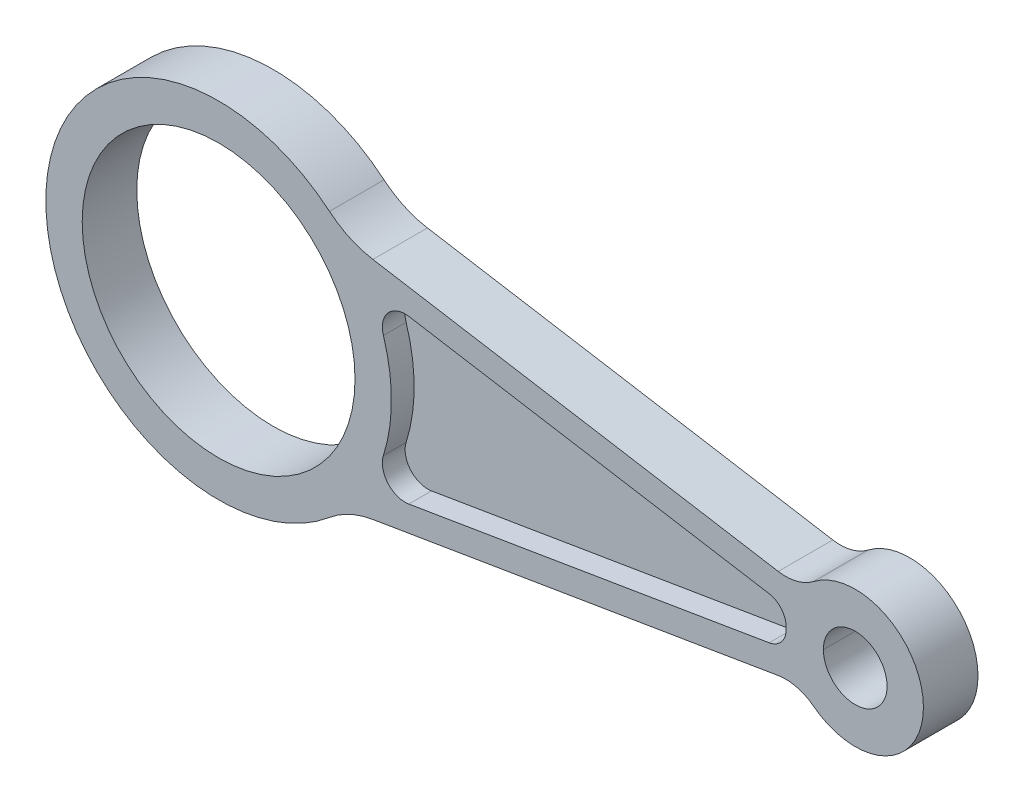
ISO-10303-21;
HEADER;
FILE_DESCRIPTION(('STEP AP214'),'2;1');
FILE_NAME('part.step','',(''),(''),'','','');
FILE_SCHEMA(('AUTOMOTIVE_DESIGN { 1 0 10303 214 1 1 1 1 }'));
ENDSEC;
DATA;
#1=APPLICATION_CONTEXT('core data for automotive mechanical design processes');
#2=APPLICATION_PROTOCOL_DEFINITION('international standard','automotive_design',2000,#1);
#3=PRODUCT_CONTEXT('',#1,'mechanical');
#4=PRODUCT('Part','Part','',(#3));
#5=PRODUCT_RELATED_PRODUCT_CATEGORY('part','',(#4));
#6=PRODUCT_DEFINITION_FORMATION('','',#4);
#7=PRODUCT_DEFINITION_CONTEXT('part definition',#1,'design');
#8=PRODUCT_DEFINITION('design','',#6,#7);
#9=PRODUCT_DEFINITION_SHAPE('','',#8);
#10=(LENGTH_UNIT() NAMED_UNIT(*) SI_UNIT(.MILLI.,.METRE.));
#11=(NAMED_UNIT(*) PLANE_ANGLE_UNIT() SI_UNIT($,.RADIAN.));
#12=(NAMED_UNIT(*) SI_UNIT($,.STERADIAN.) SOLID_ANGLE_UNIT());
#13=UNCERTAINTY_MEASURE_WITH_UNIT(LENGTH_MEASURE(1.E-05),#10,'distance_accuracy_value','');
#14=(GEOMETRIC_REPRESENTATION_CONTEXT(3) GLOBAL_UNCERTAINTY_ASSIGNED_CONTEXT((#13)) GLOBAL_UNIT_ASSIGNED_CONTEXT((#10,
#11,#12)) REPRESENTATION_CONTEXT('',''));
#15=CARTESIAN_POINT('',(0.,0.,0.));
#16=DIRECTION('',(0.,0.,1.));
#17=DIRECTION('',(1.,0.,0.));
#18=AXIS2_PLACEMENT_3D('',#15,#16,#17);
#19=CARTESIAN_POINT('',(140.,0.,12.));
#20=DIRECTION('',(0.,0.,-1.));
#21=DIRECTION('',(-1.,0.,0.));
#22=AXIS2_PLACEMENT_3D('',#19,#20,#21);
#23=CYLINDRICAL_SURFACE('',#22,7.00000000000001);
#24=CARTESIAN_POINT('',(140.,0.,0.));
#25=DIRECTION('',(0.,0.,1.));
#26=DIRECTION('',(1.,0.,0.));
#27=AXIS2_PLACEMENT_3D('',#24,#25,#26);
#28=CIRCLE('',#27,7.00000000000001);
#29=CARTESIAN_POINT('',(133.,0.,0.));
#30=VERTEX_POINT('',#29);
#31=CARTESIAN_POINT('',(147.,0.,0.));
#32=VERTEX_POINT('',#31);
#33=EDGE_CURVE('E305',#30,#32,#28,.T.);
#34=ORIENTED_EDGE('',*,*,#33,.F.);
#35=DIRECTION('',(0.,0.,1.));
#36=VECTOR('',#35,1.);
#37=CARTESIAN_POINT('',(133.,0.,12.));
#38=LINE('',#37,#36);
#39=CARTESIAN_POINT('',(133.,0.,12.));
#40=VERTEX_POINT('',#39);
#41=EDGE_CURVE('E12',#30,#40,#38,.T.);
#42=ORIENTED_EDGE('',*,*,#41,.T.);
#43=CARTESIAN_POINT('',(140.,0.,12.));
#44=DIRECTION('',(0.,0.,1.));
#45=DIRECTION('',(1.,0.,0.));
#46=AXIS2_PLACEMENT_3D('',#43,#44,#45);
#47=CIRCLE('',#46,7.00000000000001);
#48=CARTESIAN_POINT('',(147.,0.,12.));
#49=VERTEX_POINT('',#48);
#50=EDGE_CURVE('E321',#40,#49,#47,.T.);
#51=ORIENTED_EDGE('',*,*,#50,.T.);
#52=DIRECTION('',(0.,0.,-1.));
#53=VECTOR('',#52,1.);
#54=CARTESIAN_POINT('',(147.,0.,12.));
#55=LINE('',#54,#53);
#56=EDGE_CURVE('E45',#49,#32,#55,.T.);
#57=ORIENTED_EDGE('',*,*,#56,.T.);
#58=EDGE_LOOP('',(#34,#42,#51,#57));
#59=FACE_BOUND('',#58,.T.);
#60=ADVANCED_FACE('F37',(#59),#23,.F.);
#61=CARTESIAN_POINT('',(0.,0.,12.));
#62=DIRECTION('',(0.,0.,1.));
#63=DIRECTION('',(1.,0.,0.));
#64=AXIS2_PLACEMENT_3D('',#61,#62,#63);
#65=PLANE('',#64);
#66=CARTESIAN_POINT('',(41.0071259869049,12.9389187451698,12.));
#67=DIRECTION('',(0.,0.,1.));
#68=DIRECTION('',(-1.,0.,0.));
#69=AXIS2_PLACEMENT_3D('',#66,#67,#68);
#70=CIRCLE('',#69,5.);
#71=CARTESIAN_POINT('',(41.8285545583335,17.8709827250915,12.));
#72=VERTEX_POINT('',#71);
#73=CARTESIAN_POINT('',(36.2388555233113,11.4343933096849,12.));
#74=VERTEX_POINT('',#73);
#75=EDGE_CURVE('E252',#72,#74,#70,.T.);
#76=ORIENTED_EDGE('',*,*,#75,.F.);
#77=DIRECTION('',(-0.986412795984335,0.164285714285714,0.));
#78=VECTOR('',#77,1.);
#79=CARTESIAN_POINT('',(41.8285545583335,17.8709827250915,12.));
#80=LINE('',#79,#78);
#81=CARTESIAN_POINT('',(121.046940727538,4.67726787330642,12.));
#82=VERTEX_POINT('',#81);
#83=EDGE_CURVE('E266',#82,#72,#80,.T.);
#84=ORIENTED_EDGE('',*,*,#83,.F.);
#85=CARTESIAN_POINT('',(120.307655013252,0.238410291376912,12.));
#86=DIRECTION('',(0.,0.,1.));
#87=DIRECTION('',(1.,0.,0.));
#88=AXIS2_PLACEMENT_3D('',#85,#86,#87);
#89=CIRCLE('',#88,4.5);
#90=CARTESIAN_POINT('',(124.807655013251,0.238406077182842,12.));
#91=VERTEX_POINT('',#90);
#92=EDGE_CURVE('E298',#91,#82,#89,.T.);
#93=ORIENTED_EDGE('',*,*,#92,.F.);
#94=CARTESIAN_POINT('',(120.332548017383,-0.234264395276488,12.));
#95=DIRECTION('',(0.,0.,1.));
#96=DIRECTION('',(-1.,0.,0.));
#97=AXIS2_PLACEMENT_3D('',#94,#95,#96);
#98=CIRCLE('',#97,4.5);
#99=CARTESIAN_POINT('',(121.071833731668,-4.673121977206,12.));
#100=VERTEX_POINT('',#99);
#101=EDGE_CURVE('E295',#100,#91,#98,.T.);
#102=ORIENTED_EDGE('',*,*,#101,.F.);
#103=DIRECTION('',(0.986412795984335,0.164285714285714,0.));
#104=VECTOR('',#103,1.);
#105=CARTESIAN_POINT('',(41.8285545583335,-17.8709827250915,12.));
#106=LINE('',#105,#104);
#107=CARTESIAN_POINT('',(41.8285545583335,-17.8709827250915,12.));
#108=VERTEX_POINT('',#107);
#109=EDGE_CURVE('E292',#108,#100,#106,.T.);
#110=ORIENTED_EDGE('',*,*,#109,.F.);
#111=CARTESIAN_POINT('',(41.0071259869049,-12.9389187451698,12.));
#112=DIRECTION('',(0.,0.,1.));
#113=DIRECTION('',(-1.,0.,0.));
#114=AXIS2_PLACEMENT_3D('',#111,#112,#113);
#115=CIRCLE('',#114,5.);
#116=CARTESIAN_POINT('',(36.2388555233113,-11.4343933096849,12.));
#117=VERTEX_POINT('',#116);
#118=EDGE_CURVE('E289',#117,#108,#115,.T.);
#119=ORIENTED_EDGE('',*,*,#118,.F.);
#120=CARTESIAN_POINT('',(0.,0.,12.));
#121=DIRECTION('',(0.,0.,-1.));
#122=DIRECTION('',(1.,0.,0.));
#123=AXIS2_PLACEMENT_3D('',#120,#121,#122);
#124=CIRCLE('',#123,38.);
#125=EDGE_CURVE('E286',#74,#117,#124,.T.);
#126=ORIENTED_EDGE('',*,*,#125,.F.);
#127=EDGE_LOOP('',(#76,#84,#93,#102,#110,#119,#126));
#128=FACE_BOUND('',#127,.T.);
#129=CARTESIAN_POINT('',(0.,0.,12.));
#130=DIRECTION('',(0.,0.,1.));
#131=DIRECTION('',(1.,0.,0.));
#132=AXIS2_PLACEMENT_3D('',#129,#130,#131);
#133=CIRCLE('',#132,30.);
#134=CARTESIAN_POINT('',(30.,0.,12.));
#135=VERTEX_POINT('',#134);
#136=EDGE_CURVE('E325',#135,#135,#133,.T.);
#137=ORIENTED_EDGE('',*,*,#136,.F.);
#138=EDGE_LOOP('',(#137));
#139=FACE_BOUND('',#138,.T.);
#140=DIRECTION('',(-0.986412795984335,0.164285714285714,0.));
#141=VECTOR('',#140,1.);
#142=CARTESIAN_POINT('',(27.9354736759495,25.7606154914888,12.));
#143=LINE('',#142,#141);
#144=CARTESIAN_POINT('',(123.068754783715,9.91629645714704,12.));
#145=VERTEX_POINT('',#144);
#146=CARTESIAN_POINT('',(33.9230677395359,24.7633898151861,12.));
#147=VERTEX_POINT('',#146);
#148=EDGE_CURVE('E340',#145,#147,#143,.T.);
#149=ORIENTED_EDGE('',*,*,#148,.T.);
#150=CARTESIAN_POINT('',(37.2087820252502,44.4916457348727,12.));
#151=DIRECTION('',(0.,0.,1.));
#152=DIRECTION('',(1.,0.,0.));
#153=AXIS2_PLACEMENT_3D('',#150,#151,#152);
#154=CIRCLE('',#153,20.);
#155=CARTESIAN_POINT('',(24.3781675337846,29.1496989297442,12.));
#156=VERTEX_POINT('',#155);
#157=EDGE_CURVE('E388',#147,#156,#154,.F.);
#158=ORIENTED_EDGE('',*,*,#157,.T.);
#159=CARTESIAN_POINT('',(0.,0.,12.));
#160=DIRECTION('',(0.,0.,1.));
#161=DIRECTION('',(1.,0.,0.));
#162=AXIS2_PLACEMENT_3D('',#159,#160,#161);
#163=CIRCLE('',#162,38.);
#164=CARTESIAN_POINT('',(24.3781675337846,-29.1496989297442,12.));
#165=VERTEX_POINT('',#164);
#166=EDGE_CURVE('E331',#156,#165,#163,.T.);
#167=ORIENTED_EDGE('',*,*,#166,.T.);
#168=CARTESIAN_POINT('',(37.2087820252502,-44.4916457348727,12.));
#169=DIRECTION('',(0.,0.,1.));
#170=DIRECTION('',(1.,0.,0.));
#171=AXIS2_PLACEMENT_3D('',#168,#169,#170);
#172=CIRCLE('',#171,20.);
#173=CARTESIAN_POINT('',(33.9230677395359,-24.7633898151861,12.));
#174=VERTEX_POINT('',#173);
#175=EDGE_CURVE('E384',#165,#174,#172,.F.);
#176=ORIENTED_EDGE('',*,*,#175,.T.);
#177=DIRECTION('',(0.986412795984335,0.164285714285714,0.));
#178=VECTOR('',#177,1.);
#179=CARTESIAN_POINT('',(27.9354736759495,-25.7606154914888,12.));
#180=LINE('',#179,#178);
#181=CARTESIAN_POINT('',(123.068754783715,-9.91629645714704,12.));
#182=VERTEX_POINT('',#181);
#183=EDGE_CURVE('E334',#174,#182,#180,.T.);
#184=ORIENTED_EDGE('',*,*,#183,.T.);
#185=CARTESIAN_POINT('',(124.711611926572,-19.7804244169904,12.));
#186=DIRECTION('',(0.,0.,1.));
#187=DIRECTION('',(1.,0.,0.));
#188=AXIS2_PLACEMENT_3D('',#185,#186,#187);
#189=CIRCLE('',#188,10.);
#190=CARTESIAN_POINT('',(130.826967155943,-11.8682546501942,12.));
#191=VERTEX_POINT('',#190);
#192=EDGE_CURVE('E366',#182,#191,#189,.F.);
#193=ORIENTED_EDGE('',*,*,#192,.T.);
#194=CARTESIAN_POINT('',(140.,0.,12.));
#195=DIRECTION('',(0.,0.,1.));
#196=DIRECTION('',(1.,0.,0.));
#197=AXIS2_PLACEMENT_3D('',#194,#195,#196);
#198=CIRCLE('',#197,15.);
#199=CARTESIAN_POINT('',(130.826967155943,11.8682546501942,12.));
#200=VERTEX_POINT('',#199);
#201=EDGE_CURVE('E337',#191,#200,#198,.T.);
#202=ORIENTED_EDGE('',*,*,#201,.T.);
#203=CARTESIAN_POINT('',(124.711611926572,19.7804244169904,12.));
#204=DIRECTION('',(0.,0.,1.));
#205=DIRECTION('',(1.,0.,0.));
#206=AXIS2_PLACEMENT_3D('',#203,#204,#205);
#207=CIRCLE('',#206,10.);
#208=EDGE_CURVE('E370',#200,#145,#207,.F.);
#209=ORIENTED_EDGE('',*,*,#208,.T.);
#210=EDGE_LOOP('',(#149,#158,#167,#176,#184,#193,#202,#209));
#211=FACE_BOUND('',#210,.T.);
#212=EDGE_CURVE('E318',#49,#40,#47,.T.);
#213=ORIENTED_EDGE('',*,*,#212,.F.);
#214=ORIENTED_EDGE('',*,*,#50,.F.);
#215=EDGE_LOOP('',(#213,#214));
#216=FACE_BOUND('',#215,.T.);
#217=ADVANCED_FACE('F397',(#128,#139,#211,#216),#65,.T.);
#218=CARTESIAN_POINT('',(0.,0.,0.));
#219=DIRECTION('',(0.,0.,1.));
#220=DIRECTION('',(1.,0.,0.));
#221=AXIS2_PLACEMENT_3D('',#218,#219,#220);
#222=PLANE('',#221);
#223=CARTESIAN_POINT('',(0.,6.5746019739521E-13,0.));
#224=DIRECTION('',(0.,0.,1.));
#225=DIRECTION('',(-1.,0.,0.));
#226=AXIS2_PLACEMENT_3D('',#223,#224,#225);
#227=CIRCLE('',#226,38.);
#228=CARTESIAN_POINT('',(36.2388555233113,-11.4343933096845,0.));
#229=VERTEX_POINT('',#228);
#230=CARTESIAN_POINT('',(36.2388555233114,11.4343933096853,0.));
#231=VERTEX_POINT('',#230);
#232=EDGE_CURVE('E237',#229,#231,#227,.T.);
#233=ORIENTED_EDGE('',*,*,#232,.F.);
#234=CARTESIAN_POINT('',(41.0071259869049,-12.9389187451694,0.));
#235=DIRECTION('',(0.,0.,-1.));
#236=DIRECTION('',(1.,0.,0.));
#237=AXIS2_PLACEMENT_3D('',#234,#235,#236);
#238=CIRCLE('',#237,4.99999999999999);
#239=CARTESIAN_POINT('',(41.8285545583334,-17.8709827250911,0.));
#240=VERTEX_POINT('',#239);
#241=EDGE_CURVE('E202',#240,#229,#238,.T.);
#242=ORIENTED_EDGE('',*,*,#241,.F.);
#243=DIRECTION('',(-0.986412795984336,-0.164285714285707,0.));
#244=VECTOR('',#243,1.);
#245=CARTESIAN_POINT('',(41.8285545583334,-17.8709827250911,0.));
#246=LINE('',#245,#244);
#247=CARTESIAN_POINT('',(121.046940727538,-4.67726787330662,0.));
#248=VERTEX_POINT('',#247);
#249=EDGE_CURVE('E220',#248,#240,#246,.T.);
#250=ORIENTED_EDGE('',*,*,#249,.F.);
#251=CARTESIAN_POINT('',(120.307655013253,-0.23841029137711,0.));
#252=DIRECTION('',(0.,0.,-1.));
#253=DIRECTION('',(-1.,0.,0.));
#254=AXIS2_PLACEMENT_3D('',#251,#252,#253);
#255=CIRCLE('',#254,4.5);
#256=CARTESIAN_POINT('',(124.807655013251,-0.238406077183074,0.));
#257=VERTEX_POINT('',#256);
#258=EDGE_CURVE('E223',#257,#248,#255,.T.);
#259=ORIENTED_EDGE('',*,*,#258,.F.);
#260=CARTESIAN_POINT('',(120.332548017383,0.234264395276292,0.));
#261=DIRECTION('',(0.,0.,-1.));
#262=DIRECTION('',(1.,0.,0.));
#263=AXIS2_PLACEMENT_3D('',#260,#261,#262);
#264=CIRCLE('',#263,4.49999999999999);
#265=CARTESIAN_POINT('',(121.071833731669,4.67312197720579,0.));
#266=VERTEX_POINT('',#265);
#267=EDGE_CURVE('E245',#266,#257,#264,.T.);
#268=ORIENTED_EDGE('',*,*,#267,.F.);
#269=DIRECTION('',(0.986412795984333,-0.164285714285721,0.));
#270=VECTOR('',#269,1.);
#271=CARTESIAN_POINT('',(41.8285545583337,17.8709827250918,0.));
#272=LINE('',#271,#270);
#273=CARTESIAN_POINT('',(41.8285545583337,17.8709827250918,0.));
#274=VERTEX_POINT('',#273);
#275=EDGE_CURVE('E242',#274,#266,#272,.T.);
#276=ORIENTED_EDGE('',*,*,#275,.F.);
#277=CARTESIAN_POINT('',(41.0071259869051,12.9389187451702,0.));
#278=DIRECTION('',(0.,0.,-1.));
#279=DIRECTION('',(1.,0.,0.));
#280=AXIS2_PLACEMENT_3D('',#277,#278,#279);
#281=CIRCLE('',#280,5.00000000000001);
#282=EDGE_CURVE('E239',#231,#274,#281,.T.);
#283=ORIENTED_EDGE('',*,*,#282,.F.);
#284=EDGE_LOOP('',(#233,#242,#250,#259,#268,#276,#283));
#285=FACE_BOUND('',#284,.T.);
#286=CARTESIAN_POINT('',(0.,0.,0.));
#287=DIRECTION('',(0.,0.,1.));
#288=DIRECTION('',(1.,0.,0.));
#289=AXIS2_PLACEMENT_3D('',#286,#287,#288);
#290=CIRCLE('',#289,30.);
#291=CARTESIAN_POINT('',(30.,0.,0.));
#292=VERTEX_POINT('',#291);
#293=EDGE_CURVE('E320',#292,#292,#290,.T.);
#294=ORIENTED_EDGE('',*,*,#293,.T.);
#295=EDGE_LOOP('',(#294));
#296=FACE_BOUND('',#295,.T.);
#297=CARTESIAN_POINT('',(0.,0.,0.));
#298=DIRECTION('',(0.,0.,1.));
#299=DIRECTION('',(1.,0.,0.));
#300=AXIS2_PLACEMENT_3D('',#297,#298,#299);
#301=CIRCLE('',#300,38.);
#302=CARTESIAN_POINT('',(24.3781675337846,29.1496989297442,0.));
#303=VERTEX_POINT('',#302);
#304=CARTESIAN_POINT('',(24.3781675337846,-29.1496989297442,0.));
#305=VERTEX_POINT('',#304);
#306=EDGE_CURVE('E328',#303,#305,#301,.T.);
#307=ORIENTED_EDGE('',*,*,#306,.F.);
#308=CARTESIAN_POINT('',(37.2087820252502,44.4916457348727,0.));
#309=DIRECTION('',(0.,0.,1.));
#310=DIRECTION('',(1.,0.,0.));
#311=AXIS2_PLACEMENT_3D('',#308,#309,#310);
#312=CIRCLE('',#311,20.);
#313=CARTESIAN_POINT('',(33.9230677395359,24.7633898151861,0.));
#314=VERTEX_POINT('',#313);
#315=EDGE_CURVE('E386',#303,#314,#312,.T.);
#316=ORIENTED_EDGE('',*,*,#315,.T.);
#317=DIRECTION('',(-0.986412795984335,0.164285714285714,0.));
#318=VECTOR('',#317,1.);
#319=CARTESIAN_POINT('',(27.9354736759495,25.7606154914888,0.));
#320=LINE('',#319,#318);
#321=CARTESIAN_POINT('',(123.068754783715,9.91629645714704,0.));
#322=VERTEX_POINT('',#321);
#323=EDGE_CURVE('E335',#322,#314,#320,.T.);
#324=ORIENTED_EDGE('',*,*,#323,.F.);
#325=CARTESIAN_POINT('',(124.711611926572,19.7804244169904,0.));
#326=DIRECTION('',(0.,0.,1.));
#327=DIRECTION('',(1.,0.,0.));
#328=AXIS2_PLACEMENT_3D('',#325,#326,#327);
#329=CIRCLE('',#328,10.);
#330=CARTESIAN_POINT('',(130.826967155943,11.8682546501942,0.));
#331=VERTEX_POINT('',#330);
#332=EDGE_CURVE('E368',#322,#331,#329,.T.);
#333=ORIENTED_EDGE('',*,*,#332,.T.);
#334=CARTESIAN_POINT('',(140.,0.,0.));
#335=DIRECTION('',(0.,0.,1.));
#336=DIRECTION('',(1.,0.,0.));
#337=AXIS2_PLACEMENT_3D('',#334,#335,#336);
#338=CIRCLE('',#337,15.);
#339=CARTESIAN_POINT('',(130.826967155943,-11.8682546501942,0.));
#340=VERTEX_POINT('',#339);
#341=EDGE_CURVE('E348',#340,#331,#338,.T.);
#342=ORIENTED_EDGE('',*,*,#341,.F.);
#343=CARTESIAN_POINT('',(124.711611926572,-19.7804244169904,0.));
#344=DIRECTION('',(0.,0.,1.));
#345=DIRECTION('',(1.,0.,0.));
#346=AXIS2_PLACEMENT_3D('',#343,#344,#345);
#347=CIRCLE('',#346,10.);
#348=CARTESIAN_POINT('',(123.068754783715,-9.91629645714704,0.));
#349=VERTEX_POINT('',#348);
#350=EDGE_CURVE('E363',#340,#349,#347,.T.);
#351=ORIENTED_EDGE('',*,*,#350,.T.);
#352=DIRECTION('',(0.986412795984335,0.164285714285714,0.));
#353=VECTOR('',#352,1.);
#354=CARTESIAN_POINT('',(27.9354736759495,-25.7606154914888,0.));
#355=LINE('',#354,#353);
#356=CARTESIAN_POINT('',(33.9230677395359,-24.7633898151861,0.));
#357=VERTEX_POINT('',#356);
#358=EDGE_CURVE('E346',#357,#349,#355,.T.);
#359=ORIENTED_EDGE('',*,*,#358,.F.);
#360=CARTESIAN_POINT('',(37.2087820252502,-44.4916457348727,0.));
#361=DIRECTION('',(0.,0.,1.));
#362=DIRECTION('',(1.,0.,0.));
#363=AXIS2_PLACEMENT_3D('',#360,#361,#362);
#364=CIRCLE('',#363,20.);
#365=EDGE_CURVE('E382',#357,#305,#364,.T.);
#366=ORIENTED_EDGE('',*,*,#365,.T.);
#367=EDGE_LOOP('',(#307,#316,#324,#333,#342,#351,#359,#366));
#368=FACE_BOUND('',#367,.T.);
#369=EDGE_CURVE('E322',#32,#30,#28,.T.);
#370=ORIENTED_EDGE('',*,*,#369,.T.);
#371=ORIENTED_EDGE('',*,*,#33,.T.);
#372=EDGE_LOOP('',(#370,#371));
#373=FACE_BOUND('',#372,.T.);
#374=ADVANCED_FACE('F394',(#285,#296,#368,#373),#222,.F.);
#375=CARTESIAN_POINT('',(0.,0.,12.));
#376=DIRECTION('',(0.,0.,-1.));
#377=DIRECTION('',(-1.,0.,0.));
#378=AXIS2_PLACEMENT_3D('',#375,#376,#377);
#379=CYLINDRICAL_SURFACE('',#378,38.);
#380=ORIENTED_EDGE('',*,*,#306,.T.);
#381=DIRECTION('',(0.,0.,-1.));
#382=VECTOR('',#381,1.);
#383=CARTESIAN_POINT('',(24.3781675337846,-29.1496989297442,12.));
#384=LINE('',#383,#382);
#385=EDGE_CURVE('E378',#305,#165,#384,.F.);
#386=ORIENTED_EDGE('',*,*,#385,.T.);
#387=ORIENTED_EDGE('',*,*,#166,.F.);
#388=DIRECTION('',(0.,0.,-1.));
#389=VECTOR('',#388,1.);
#390=CARTESIAN_POINT('',(24.3781675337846,29.1496989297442,12.));
#391=LINE('',#390,#389);
#392=EDGE_CURVE('E375',#156,#303,#391,.T.);
#393=ORIENTED_EDGE('',*,*,#392,.T.);
#394=EDGE_LOOP('',(#380,#386,#387,#393));
#395=FACE_BOUND('',#394,.T.);
#396=ADVANCED_FACE('F396',(#395),#379,.T.);
#397=CARTESIAN_POINT('',(27.9354736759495,-25.7606154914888,12.));
#398=DIRECTION('',(-0.164285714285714,0.986412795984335,0.));
#399=DIRECTION('',(-0.986412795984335,-0.164285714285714,0.));
#400=AXIS2_PLACEMENT_3D('',#397,#398,#399);
#401=PLANE('',#400);
#402=ORIENTED_EDGE('',*,*,#183,.F.);
#403=DIRECTION('',(0.,0.,1.));
#404=VECTOR('',#403,1.);
#405=CARTESIAN_POINT('',(33.9230677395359,-24.7633898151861,0.));
#406=LINE('',#405,#404);
#407=EDGE_CURVE('E372',#174,#357,#406,.F.);
#408=ORIENTED_EDGE('',*,*,#407,.T.);
#409=ORIENTED_EDGE('',*,*,#358,.T.);
#410=DIRECTION('',(0.,0.,1.));
#411=VECTOR('',#410,1.);
#412=CARTESIAN_POINT('',(123.068754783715,-9.91629645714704,12.));
#413=LINE('',#412,#411);
#414=EDGE_CURVE('E357',#349,#182,#413,.T.);
#415=ORIENTED_EDGE('',*,*,#414,.T.);
#416=EDGE_LOOP('',(#402,#408,#409,#415));
#417=FACE_BOUND('',#416,.T.);
#418=ADVANCED_FACE('F405',(#417),#401,.F.);
#419=CARTESIAN_POINT('',(140.,0.,12.));
#420=DIRECTION('',(0.,0.,-1.));
#421=DIRECTION('',(-1.,0.,0.));
#422=AXIS2_PLACEMENT_3D('',#419,#420,#421);
#423=CYLINDRICAL_SURFACE('',#422,15.);
#424=ORIENTED_EDGE('',*,*,#201,.F.);
#425=DIRECTION('',(0.,0.,-1.));
#426=VECTOR('',#425,1.);
#427=CARTESIAN_POINT('',(130.826967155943,-11.8682546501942,12.));
#428=LINE('',#427,#426);
#429=EDGE_CURVE('E354',#191,#340,#428,.T.);
#430=ORIENTED_EDGE('',*,*,#429,.T.);
#431=ORIENTED_EDGE('',*,*,#341,.T.);
#432=DIRECTION('',(0.,0.,-1.));
#433=VECTOR('',#432,1.);
#434=CARTESIAN_POINT('',(130.826967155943,11.8682546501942,12.));
#435=LINE('',#434,#433);
#436=EDGE_CURVE('E343',#331,#200,#435,.F.);
#437=ORIENTED_EDGE('',*,*,#436,.T.);
#438=EDGE_LOOP('',(#424,#430,#431,#437));
#439=FACE_BOUND('',#438,.T.);
#440=ADVANCED_FACE('F434',(#439),#423,.T.);
#441=CARTESIAN_POINT('',(27.9354736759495,25.7606154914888,12.));
#442=DIRECTION('',(-0.164285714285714,-0.986412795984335,0.));
#443=DIRECTION('',(0.986412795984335,-0.164285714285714,0.));
#444=AXIS2_PLACEMENT_3D('',#441,#442,#443);
#445=PLANE('',#444);
#446=ORIENTED_EDGE('',*,*,#323,.T.);
#447=DIRECTION('',(0.,0.,1.));
#448=VECTOR('',#447,1.);
#449=CARTESIAN_POINT('',(33.9230677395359,24.7633898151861,12.));
#450=LINE('',#449,#448);
#451=EDGE_CURVE('E380',#314,#147,#450,.T.);
#452=ORIENTED_EDGE('',*,*,#451,.T.);
#453=ORIENTED_EDGE('',*,*,#148,.F.);
#454=DIRECTION('',(0.,0.,1.));
#455=VECTOR('',#454,1.);
#456=CARTESIAN_POINT('',(123.068754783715,9.91629645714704,0.));
#457=LINE('',#456,#455);
#458=EDGE_CURVE('E360',#145,#322,#457,.F.);
#459=ORIENTED_EDGE('',*,*,#458,.T.);
#460=EDGE_LOOP('',(#446,#452,#453,#459));
#461=FACE_BOUND('',#460,.T.);
#462=ADVANCED_FACE('F428',(#461),#445,.F.);
#463=CARTESIAN_POINT('',(0.,0.,12.));
#464=DIRECTION('',(0.,0.,-1.));
#465=DIRECTION('',(-1.,0.,0.));
#466=AXIS2_PLACEMENT_3D('',#463,#464,#465);
#467=CYLINDRICAL_SURFACE('',#466,30.);
#468=ORIENTED_EDGE('',*,*,#136,.T.);
#469=EDGE_LOOP('',(#468));
#470=FACE_BOUND('',#469,.T.);
#471=ORIENTED_EDGE('',*,*,#293,.F.);
#472=EDGE_LOOP('',(#471));
#473=FACE_BOUND('',#472,.T.);
#474=ADVANCED_FACE('F420',(#470,#473),#467,.F.);
#475=ORIENTED_EDGE('',*,*,#41,.F.);
#476=ORIENTED_EDGE('',*,*,#369,.F.);
#477=ORIENTED_EDGE('',*,*,#56,.F.);
#478=ORIENTED_EDGE('',*,*,#212,.T.);
#479=EDGE_LOOP('',(#475,#476,#477,#478));
#480=FACE_BOUND('',#479,.T.);
#481=ADVANCED_FACE('F392',(#480),#23,.F.);
#482=CARTESIAN_POINT('',(124.711611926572,-19.7804244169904,12.));
#483=DIRECTION('',(0.,0.,-1.));
#484=DIRECTION('',(-1.,0.,0.));
#485=AXIS2_PLACEMENT_3D('',#482,#483,#484);
#486=CYLINDRICAL_SURFACE('',#485,10.);
#487=ORIENTED_EDGE('',*,*,#192,.F.);
#488=ORIENTED_EDGE('',*,*,#414,.F.);
#489=ORIENTED_EDGE('',*,*,#350,.F.);
#490=ORIENTED_EDGE('',*,*,#429,.F.);
#491=EDGE_LOOP('',(#487,#488,#489,#490));
#492=FACE_BOUND('',#491,.T.);
#493=ADVANCED_FACE('F419',(#492),#486,.F.);
#494=CARTESIAN_POINT('',(124.711611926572,19.7804244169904,12.));
#495=DIRECTION('',(0.,0.,-1.));
#496=DIRECTION('',(-1.,0.,0.));
#497=AXIS2_PLACEMENT_3D('',#494,#495,#496);
#498=CYLINDRICAL_SURFACE('',#497,10.);
#499=ORIENTED_EDGE('',*,*,#208,.F.);
#500=ORIENTED_EDGE('',*,*,#436,.F.);
#501=ORIENTED_EDGE('',*,*,#332,.F.);
#502=ORIENTED_EDGE('',*,*,#458,.F.);
#503=EDGE_LOOP('',(#499,#500,#501,#502));
#504=FACE_BOUND('',#503,.T.);
#505=ADVANCED_FACE('F424',(#504),#498,.F.);
#506=CARTESIAN_POINT('',(37.2087820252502,-44.4916457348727,12.));
#507=DIRECTION('',(0.,0.,-1.));
#508=DIRECTION('',(-1.,0.,0.));
#509=AXIS2_PLACEMENT_3D('',#506,#507,#508);
#510=CYLINDRICAL_SURFACE('',#509,20.);
#511=ORIENTED_EDGE('',*,*,#175,.F.);
#512=ORIENTED_EDGE('',*,*,#385,.F.);
#513=ORIENTED_EDGE('',*,*,#365,.F.);
#514=ORIENTED_EDGE('',*,*,#407,.F.);
#515=EDGE_LOOP('',(#511,#512,#513,#514));
#516=FACE_BOUND('',#515,.T.);
#517=ADVANCED_FACE('F448',(#516),#510,.F.);
#518=CARTESIAN_POINT('',(37.2087820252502,44.4916457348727,12.));
#519=DIRECTION('',(0.,0.,-1.));
#520=DIRECTION('',(-1.,0.,0.));
#521=AXIS2_PLACEMENT_3D('',#518,#519,#520);
#522=CYLINDRICAL_SURFACE('',#521,20.);
#523=ORIENTED_EDGE('',*,*,#157,.F.);
#524=ORIENTED_EDGE('',*,*,#451,.F.);
#525=ORIENTED_EDGE('',*,*,#315,.F.);
#526=ORIENTED_EDGE('',*,*,#392,.F.);
#527=EDGE_LOOP('',(#523,#524,#525,#526));
#528=FACE_BOUND('',#527,.T.);
#529=ADVANCED_FACE('F39',(#528),#522,.F.);
#530=CARTESIAN_POINT('',(41.0071259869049,12.9389187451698,7.));
#531=DIRECTION('',(0.,0.,1.));
#532=DIRECTION('',(1.,0.,0.));
#533=AXIS2_PLACEMENT_3D('',#530,#531,#532);
#534=CYLINDRICAL_SURFACE('',#533,5.);
#535=ORIENTED_EDGE('',*,*,#75,.T.);
#536=DIRECTION('',(0.,0.,1.));
#537=VECTOR('',#536,1.);
#538=CARTESIAN_POINT('',(36.2388555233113,11.4343933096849,7.));
#539=LINE('',#538,#537);
#540=CARTESIAN_POINT('',(36.2388555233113,11.4343933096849,7.));
#541=VERTEX_POINT('',#540);
#542=EDGE_CURVE('E284',#541,#74,#539,.T.);
#543=ORIENTED_EDGE('',*,*,#542,.F.);
#544=CARTESIAN_POINT('',(41.0071259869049,12.9389187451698,7.));
#545=DIRECTION('',(0.,0.,1.));
#546=DIRECTION('',(-1.,0.,0.));
#547=AXIS2_PLACEMENT_3D('',#544,#545,#546);
#548=CIRCLE('',#547,5.);
#549=CARTESIAN_POINT('',(41.8285545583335,17.8709827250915,7.));
#550=VERTEX_POINT('',#549);
#551=EDGE_CURVE('E262',#550,#541,#548,.T.);
#552=ORIENTED_EDGE('',*,*,#551,.F.);
#553=DIRECTION('',(0.,0.,1.));
#554=VECTOR('',#553,1.);
#555=CARTESIAN_POINT('',(41.8285545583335,17.8709827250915,7.));
#556=LINE('',#555,#554);
#557=EDGE_CURVE('E303',#550,#72,#556,.T.);
#558=ORIENTED_EDGE('',*,*,#557,.T.);
#559=EDGE_LOOP('',(#535,#543,#552,#558));
#560=FACE_BOUND('',#559,.T.);
#561=ADVANCED_FACE('F469',(#560),#534,.F.);
#562=CARTESIAN_POINT('',(41.8285545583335,17.8709827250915,7.));
#563=DIRECTION('',(0.164285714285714,0.986412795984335,0.));
#564=DIRECTION('',(-0.986412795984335,0.164285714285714,0.));
#565=AXIS2_PLACEMENT_3D('',#562,#563,#564);
#566=PLANE('',#565);
#567=ORIENTED_EDGE('',*,*,#83,.T.);
#568=ORIENTED_EDGE('',*,*,#557,.F.);
#569=DIRECTION('',(-0.986412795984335,0.164285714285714,0.));
#570=VECTOR('',#569,1.);
#571=CARTESIAN_POINT('',(41.8285545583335,17.8709827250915,7.));
#572=LINE('',#571,#570);
#573=CARTESIAN_POINT('',(121.046940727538,4.67726787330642,7.));
#574=VERTEX_POINT('',#573);
#575=EDGE_CURVE('E281',#574,#550,#572,.T.);
#576=ORIENTED_EDGE('',*,*,#575,.F.);
#577=DIRECTION('',(0.,0.,1.));
#578=VECTOR('',#577,1.);
#579=CARTESIAN_POINT('',(121.046940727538,4.67726787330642,7.));
#580=LINE('',#579,#578);
#581=EDGE_CURVE('E306',#574,#82,#580,.T.);
#582=ORIENTED_EDGE('',*,*,#581,.T.);
#583=EDGE_LOOP('',(#567,#568,#576,#582));
#584=FACE_BOUND('',#583,.T.);
#585=ADVANCED_FACE('F474',(#584),#566,.F.);
#586=CARTESIAN_POINT('',(120.307655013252,0.238410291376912,7.));
#587=DIRECTION('',(0.,0.,1.));
#588=DIRECTION('',(1.,0.,0.));
#589=AXIS2_PLACEMENT_3D('',#586,#587,#588);
#590=CYLINDRICAL_SURFACE('',#589,4.5);
#591=ORIENTED_EDGE('',*,*,#92,.T.);
#592=ORIENTED_EDGE('',*,*,#581,.F.);
#593=CARTESIAN_POINT('',(120.307655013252,0.238410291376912,7.));
#594=DIRECTION('',(0.,0.,1.));
#595=DIRECTION('',(1.,0.,0.));
#596=AXIS2_PLACEMENT_3D('',#593,#594,#595);
#597=CIRCLE('',#596,4.5);
#598=CARTESIAN_POINT('',(124.807655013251,0.238406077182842,7.));
#599=VERTEX_POINT('',#598);
#600=EDGE_CURVE('E278',#599,#574,#597,.T.);
#601=ORIENTED_EDGE('',*,*,#600,.F.);
#602=DIRECTION('',(0.,0.,1.));
#603=VECTOR('',#602,1.);
#604=CARTESIAN_POINT('',(124.807655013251,0.238406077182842,7.));
#605=LINE('',#604,#603);
#606=EDGE_CURVE('E308',#599,#91,#605,.T.);
#607=ORIENTED_EDGE('',*,*,#606,.T.);
#608=EDGE_LOOP('',(#591,#592,#601,#607));
#609=FACE_BOUND('',#608,.T.);
#610=ADVANCED_FACE('F521',(#609),#590,.F.);
#611=CARTESIAN_POINT('',(120.332548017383,-0.234264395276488,7.));
#612=DIRECTION('',(0.,0.,1.));
#613=DIRECTION('',(1.,0.,0.));
#614=AXIS2_PLACEMENT_3D('',#611,#612,#613);
#615=CYLINDRICAL_SURFACE('',#614,4.5);
#616=ORIENTED_EDGE('',*,*,#101,.T.);
#617=ORIENTED_EDGE('',*,*,#606,.F.);
#618=CARTESIAN_POINT('',(120.332548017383,-0.234264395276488,7.));
#619=DIRECTION('',(0.,0.,1.));
#620=DIRECTION('',(-1.,0.,0.));
#621=AXIS2_PLACEMENT_3D('',#618,#619,#620);
#622=CIRCLE('',#621,4.5);
#623=CARTESIAN_POINT('',(121.071833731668,-4.673121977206,7.));
#624=VERTEX_POINT('',#623);
#625=EDGE_CURVE('E275',#624,#599,#622,.T.);
#626=ORIENTED_EDGE('',*,*,#625,.F.);
#627=DIRECTION('',(0.,0.,1.));
#628=VECTOR('',#627,1.);
#629=CARTESIAN_POINT('',(121.071833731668,-4.673121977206,7.));
#630=LINE('',#629,#628);
#631=EDGE_CURVE('E310',#624,#100,#630,.T.);
#632=ORIENTED_EDGE('',*,*,#631,.T.);
#633=EDGE_LOOP('',(#616,#617,#626,#632));
#634=FACE_BOUND('',#633,.T.);
#635=ADVANCED_FACE('F531',(#634),#615,.F.);
#636=CARTESIAN_POINT('',(41.8285545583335,-17.8709827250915,7.));
#637=DIRECTION('',(0.164285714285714,-0.986412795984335,0.));
#638=DIRECTION('',(0.986412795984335,0.164285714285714,0.));
#639=AXIS2_PLACEMENT_3D('',#636,#637,#638);
#640=PLANE('',#639);
#641=ORIENTED_EDGE('',*,*,#109,.T.);
#642=ORIENTED_EDGE('',*,*,#631,.F.);
#643=DIRECTION('',(0.986412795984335,0.164285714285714,0.));
#644=VECTOR('',#643,1.);
#645=CARTESIAN_POINT('',(41.8285545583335,-17.8709827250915,7.));
#646=LINE('',#645,#644);
#647=CARTESIAN_POINT('',(41.8285545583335,-17.8709827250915,7.));
#648=VERTEX_POINT('',#647);
#649=EDGE_CURVE('E272',#648,#624,#646,.T.);
#650=ORIENTED_EDGE('',*,*,#649,.F.);
#651=DIRECTION('',(0.,0.,1.));
#652=VECTOR('',#651,1.);
#653=CARTESIAN_POINT('',(41.8285545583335,-17.8709827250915,7.));
#654=LINE('',#653,#652);
#655=EDGE_CURVE('E312',#648,#108,#654,.T.);
#656=ORIENTED_EDGE('',*,*,#655,.T.);
#657=EDGE_LOOP('',(#641,#642,#650,#656));
#658=FACE_BOUND('',#657,.T.);
#659=ADVANCED_FACE('F541',(#658),#640,.F.);
#660=CARTESIAN_POINT('',(41.0071259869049,-12.9389187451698,7.));
#661=DIRECTION('',(0.,0.,1.));
#662=DIRECTION('',(1.,0.,0.));
#663=AXIS2_PLACEMENT_3D('',#660,#661,#662);
#664=CYLINDRICAL_SURFACE('',#663,5.);
#665=ORIENTED_EDGE('',*,*,#118,.T.);
#666=ORIENTED_EDGE('',*,*,#655,.F.);
#667=CARTESIAN_POINT('',(41.0071259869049,-12.9389187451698,7.));
#668=DIRECTION('',(0.,0.,1.));
#669=DIRECTION('',(-1.,0.,0.));
#670=AXIS2_PLACEMENT_3D('',#667,#668,#669);
#671=CIRCLE('',#670,5.);
#672=CARTESIAN_POINT('',(36.2388555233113,-11.4343933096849,7.));
#673=VERTEX_POINT('',#672);
#674=EDGE_CURVE('E269',#673,#648,#671,.T.);
#675=ORIENTED_EDGE('',*,*,#674,.F.);
#676=DIRECTION('',(0.,0.,1.));
#677=VECTOR('',#676,1.);
#678=CARTESIAN_POINT('',(36.2388555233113,-11.4343933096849,7.));
#679=LINE('',#678,#677);
#680=EDGE_CURVE('E314',#673,#117,#679,.T.);
#681=ORIENTED_EDGE('',*,*,#680,.T.);
#682=EDGE_LOOP('',(#665,#666,#675,#681));
#683=FACE_BOUND('',#682,.T.);
#684=ADVANCED_FACE('F551',(#683),#664,.F.);
#685=CARTESIAN_POINT('',(0.,0.,7.));
#686=DIRECTION('',(0.,0.,1.));
#687=DIRECTION('',(1.,0.,0.));
#688=AXIS2_PLACEMENT_3D('',#685,#686,#687);
#689=CYLINDRICAL_SURFACE('',#688,38.);
#690=ORIENTED_EDGE('',*,*,#125,.T.);
#691=ORIENTED_EDGE('',*,*,#680,.F.);
#692=CARTESIAN_POINT('',(0.,0.,7.));
#693=DIRECTION('',(0.,0.,-1.));
#694=DIRECTION('',(1.,0.,0.));
#695=AXIS2_PLACEMENT_3D('',#692,#693,#694);
#696=CIRCLE('',#695,38.);
#697=EDGE_CURVE('E265',#541,#673,#696,.T.);
#698=ORIENTED_EDGE('',*,*,#697,.F.);
#699=ORIENTED_EDGE('',*,*,#542,.T.);
#700=EDGE_LOOP('',(#690,#691,#698,#699));
#701=FACE_BOUND('',#700,.T.);
#702=ADVANCED_FACE('F561',(#701),#689,.T.);
#703=CARTESIAN_POINT('',(41.0071259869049,12.9389187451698,7.));
#704=DIRECTION('',(0.,0.,-1.));
#705=DIRECTION('',(-1.,0.,0.));
#706=AXIS2_PLACEMENT_3D('',#703,#704,#705);
#707=PLANE('',#706);
#708=ORIENTED_EDGE('',*,*,#551,.T.);
#709=ORIENTED_EDGE('',*,*,#697,.T.);
#710=ORIENTED_EDGE('',*,*,#674,.T.);
#711=ORIENTED_EDGE('',*,*,#649,.T.);
#712=ORIENTED_EDGE('',*,*,#625,.T.);
#713=ORIENTED_EDGE('',*,*,#600,.T.);
#714=ORIENTED_EDGE('',*,*,#575,.T.);
#715=EDGE_LOOP('',(#708,#709,#710,#711,#712,#713,#714));
#716=FACE_BOUND('',#715,.T.);
#717=ADVANCED_FACE('F571',(#716),#707,.F.);
#718=CARTESIAN_POINT('',(41.0071259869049,-12.9389187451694,5.));
#719=DIRECTION('',(0.,0.,-1.));
#720=DIRECTION('',(-1.,0.,0.));
#721=AXIS2_PLACEMENT_3D('',#718,#719,#720);
#722=CYLINDRICAL_SURFACE('',#721,4.99999999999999);
#723=ORIENTED_EDGE('',*,*,#241,.T.);
#724=DIRECTION('',(0.,0.,-1.));
#725=VECTOR('',#724,1.);
#726=CARTESIAN_POINT('',(36.2388555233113,-11.4343933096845,5.));
#727=LINE('',#726,#725);
#728=CARTESIAN_POINT('',(36.2388555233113,-11.4343933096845,5.));
#729=VERTEX_POINT('',#728);
#730=EDGE_CURVE('E195',#729,#229,#727,.T.);
#731=ORIENTED_EDGE('',*,*,#730,.F.);
#732=CARTESIAN_POINT('',(41.0071259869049,-12.9389187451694,5.));
#733=DIRECTION('',(0.,0.,-1.));
#734=DIRECTION('',(1.,0.,0.));
#735=AXIS2_PLACEMENT_3D('',#732,#733,#734);
#736=CIRCLE('',#735,4.99999999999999);
#737=CARTESIAN_POINT('',(41.8285545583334,-17.8709827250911,5.));
#738=VERTEX_POINT('',#737);
#739=EDGE_CURVE('E199',#738,#729,#736,.T.);
#740=ORIENTED_EDGE('',*,*,#739,.F.);
#741=DIRECTION('',(0.,0.,-1.));
#742=VECTOR('',#741,1.);
#743=CARTESIAN_POINT('',(41.8285545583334,-17.8709827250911,5.));
#744=LINE('',#743,#742);
#745=EDGE_CURVE('E250',#738,#240,#744,.T.);
#746=ORIENTED_EDGE('',*,*,#745,.T.);
#747=EDGE_LOOP('',(#723,#731,#740,#746));
#748=FACE_BOUND('',#747,.T.);
#749=ADVANCED_FACE('F197',(#748),#722,.F.);
#750=CARTESIAN_POINT('',(41.8285545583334,-17.8709827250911,5.));
#751=DIRECTION('',(0.164285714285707,-0.986412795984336,0.));
#752=DIRECTION('',(0.986412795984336,0.164285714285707,0.));
#753=AXIS2_PLACEMENT_3D('',#750,#751,#752);
#754=PLANE('',#753);
#755=ORIENTED_EDGE('',*,*,#249,.T.);
#756=ORIENTED_EDGE('',*,*,#745,.F.);
#757=DIRECTION('',(-0.986412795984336,-0.164285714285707,0.));
#758=VECTOR('',#757,1.);
#759=CARTESIAN_POINT('',(41.8285545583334,-17.8709827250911,5.));
#760=LINE('',#759,#758);
#761=CARTESIAN_POINT('',(121.046940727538,-4.67726787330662,5.));
#762=VERTEX_POINT('',#761);
#763=EDGE_CURVE('E207',#762,#738,#760,.T.);
#764=ORIENTED_EDGE('',*,*,#763,.F.);
#765=DIRECTION('',(0.,0.,-1.));
#766=VECTOR('',#765,1.);
#767=CARTESIAN_POINT('',(121.046940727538,-4.67726787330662,5.));
#768=LINE('',#767,#766);
#769=EDGE_CURVE('E253',#762,#248,#768,.T.);
#770=ORIENTED_EDGE('',*,*,#769,.T.);
#771=EDGE_LOOP('',(#755,#756,#764,#770));
#772=FACE_BOUND('',#771,.T.);
#773=ADVANCED_FACE('F590',(#772),#754,.F.);
#774=CARTESIAN_POINT('',(120.307655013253,-0.23841029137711,5.));
#775=DIRECTION('',(0.,0.,-1.));
#776=DIRECTION('',(-1.,0.,0.));
#777=AXIS2_PLACEMENT_3D('',#774,#775,#776);
#778=CYLINDRICAL_SURFACE('',#777,4.5);
#779=ORIENTED_EDGE('',*,*,#258,.T.);
#780=ORIENTED_EDGE('',*,*,#769,.F.);
#781=CARTESIAN_POINT('',(120.307655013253,-0.23841029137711,5.));
#782=DIRECTION('',(0.,0.,-1.));
#783=DIRECTION('',(-1.,0.,0.));
#784=AXIS2_PLACEMENT_3D('',#781,#782,#783);
#785=CIRCLE('',#784,4.5);
#786=CARTESIAN_POINT('',(124.807655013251,-0.238406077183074,5.));
#787=VERTEX_POINT('',#786);
#788=EDGE_CURVE('E233',#787,#762,#785,.T.);
#789=ORIENTED_EDGE('',*,*,#788,.F.);
#790=DIRECTION('',(0.,0.,-1.));
#791=VECTOR('',#790,1.);
#792=CARTESIAN_POINT('',(124.807655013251,-0.238406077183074,5.));
#793=LINE('',#792,#791);
#794=EDGE_CURVE('E255',#787,#257,#793,.T.);
#795=ORIENTED_EDGE('',*,*,#794,.T.);
#796=EDGE_LOOP('',(#779,#780,#789,#795));
#797=FACE_BOUND('',#796,.T.);
#798=ADVANCED_FACE('F599',(#797),#778,.F.);
#799=CARTESIAN_POINT('',(120.332548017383,0.234264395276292,5.));
#800=DIRECTION('',(0.,0.,-1.));
#801=DIRECTION('',(-1.,0.,0.));
#802=AXIS2_PLACEMENT_3D('',#799,#800,#801);
#803=CYLINDRICAL_SURFACE('',#802,4.49999999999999);
#804=ORIENTED_EDGE('',*,*,#267,.T.);
#805=ORIENTED_EDGE('',*,*,#794,.F.);
#806=CARTESIAN_POINT('',(120.332548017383,0.234264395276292,5.));
#807=DIRECTION('',(0.,0.,-1.));
#808=DIRECTION('',(1.,0.,0.));
#809=AXIS2_PLACEMENT_3D('',#806,#807,#808);
#810=CIRCLE('',#809,4.49999999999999);
#811=CARTESIAN_POINT('',(121.071833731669,4.67312197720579,5.));
#812=VERTEX_POINT('',#811);
#813=EDGE_CURVE('E230',#812,#787,#810,.T.);
#814=ORIENTED_EDGE('',*,*,#813,.F.);
#815=DIRECTION('',(0.,0.,-1.));
#816=VECTOR('',#815,1.);
#817=CARTESIAN_POINT('',(121.071833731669,4.67312197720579,5.));
#818=LINE('',#817,#816);
#819=EDGE_CURVE('E257',#812,#266,#818,.T.);
#820=ORIENTED_EDGE('',*,*,#819,.T.);
#821=EDGE_LOOP('',(#804,#805,#814,#820));
#822=FACE_BOUND('',#821,.T.);
#823=ADVANCED_FACE('F609',(#822),#803,.F.);
#824=CARTESIAN_POINT('',(41.8285545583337,17.8709827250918,5.));
#825=DIRECTION('',(0.164285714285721,0.986412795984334,0.));
#826=DIRECTION('',(-0.986412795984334,0.164285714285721,0.));
#827=AXIS2_PLACEMENT_3D('',#824,#825,#826);
#828=PLANE('',#827);
#829=ORIENTED_EDGE('',*,*,#275,.T.);
#830=ORIENTED_EDGE('',*,*,#819,.F.);
#831=DIRECTION('',(0.986412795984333,-0.164285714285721,0.));
#832=VECTOR('',#831,1.);
#833=CARTESIAN_POINT('',(41.8285545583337,17.8709827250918,5.));
#834=LINE('',#833,#832);
#835=CARTESIAN_POINT('',(41.8285545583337,17.8709827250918,5.));
#836=VERTEX_POINT('',#835);
#837=EDGE_CURVE('E227',#836,#812,#834,.T.);
#838=ORIENTED_EDGE('',*,*,#837,.F.);
#839=DIRECTION('',(0.,0.,-1.));
#840=VECTOR('',#839,1.);
#841=CARTESIAN_POINT('',(41.8285545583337,17.8709827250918,5.));
#842=LINE('',#841,#840);
#843=EDGE_CURVE('E259',#836,#274,#842,.T.);
#844=ORIENTED_EDGE('',*,*,#843,.T.);
#845=EDGE_LOOP('',(#829,#830,#838,#844));
#846=FACE_BOUND('',#845,.T.);
#847=ADVANCED_FACE('F619',(#846),#828,.F.);
#848=CARTESIAN_POINT('',(41.0071259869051,12.9389187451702,5.));
#849=DIRECTION('',(0.,0.,-1.));
#850=DIRECTION('',(-1.,0.,0.));
#851=AXIS2_PLACEMENT_3D('',#848,#849,#850);
#852=CYLINDRICAL_SURFACE('',#851,5.00000000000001);
#853=ORIENTED_EDGE('',*,*,#282,.T.);
#854=ORIENTED_EDGE('',*,*,#843,.F.);
#855=CARTESIAN_POINT('',(41.0071259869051,12.9389187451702,5.));
#856=DIRECTION('',(0.,0.,-1.));
#857=DIRECTION('',(1.,0.,0.));
#858=AXIS2_PLACEMENT_3D('',#855,#856,#857);
#859=CIRCLE('',#858,5.00000000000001);
#860=CARTESIAN_POINT('',(36.2388555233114,11.4343933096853,5.));
#861=VERTEX_POINT('',#860);
#862=EDGE_CURVE('E215',#861,#836,#859,.T.);
#863=ORIENTED_EDGE('',*,*,#862,.F.);
#864=DIRECTION('',(0.,0.,-1.));
#865=VECTOR('',#864,1.);
#866=CARTESIAN_POINT('',(36.2388555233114,11.4343933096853,5.));
#867=LINE('',#866,#865);
#868=EDGE_CURVE('E206',#861,#231,#867,.T.);
#869=ORIENTED_EDGE('',*,*,#868,.T.);
#870=EDGE_LOOP('',(#853,#854,#863,#869));
#871=FACE_BOUND('',#870,.T.);
#872=ADVANCED_FACE('F629',(#871),#852,.F.);
#873=CARTESIAN_POINT('',(0.,6.5746019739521E-13,5.));
#874=DIRECTION('',(0.,0.,-1.));
#875=DIRECTION('',(-1.,0.,0.));
#876=AXIS2_PLACEMENT_3D('',#873,#874,#875);
#877=CYLINDRICAL_SURFACE('',#876,38.);
#878=ORIENTED_EDGE('',*,*,#232,.T.);
#879=ORIENTED_EDGE('',*,*,#868,.F.);
#880=CARTESIAN_POINT('',(0.,6.5746019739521E-13,5.));
#881=DIRECTION('',(0.,0.,1.));
#882=DIRECTION('',(-1.,0.,0.));
#883=AXIS2_PLACEMENT_3D('',#880,#881,#882);
#884=CIRCLE('',#883,38.);
#885=EDGE_CURVE('E210',#729,#861,#884,.T.);
#886=ORIENTED_EDGE('',*,*,#885,.F.);
#887=ORIENTED_EDGE('',*,*,#730,.T.);
#888=EDGE_LOOP('',(#878,#879,#886,#887));
#889=FACE_BOUND('',#888,.T.);
#890=ADVANCED_FACE('F211',(#889),#877,.T.);
#891=CARTESIAN_POINT('',(41.0071259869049,-12.9389187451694,5.));
#892=DIRECTION('',(0.,0.,1.));
#893=DIRECTION('',(1.,0.,0.));
#894=AXIS2_PLACEMENT_3D('',#891,#892,#893);
#895=PLANE('',#894);
#896=ORIENTED_EDGE('',*,*,#739,.T.);
#897=ORIENTED_EDGE('',*,*,#885,.T.);
#898=ORIENTED_EDGE('',*,*,#862,.T.);
#899=ORIENTED_EDGE('',*,*,#837,.T.);
#900=ORIENTED_EDGE('',*,*,#813,.T.);
#901=ORIENTED_EDGE('',*,*,#788,.T.);
#902=ORIENTED_EDGE('',*,*,#763,.T.);
#903=EDGE_LOOP('',(#896,#897,#898,#899,#900,#901,#902));
#904=FACE_BOUND('',#903,.T.);
#905=ADVANCED_FACE('F217',(#904),#895,.F.);
#906=CLOSED_SHELL('',(#60,#217,#374,#396,#418,#440,#462,#474,#481,#493,#505,#517,#529,#561,#585,
#610,#635,#659,#684,#702,#717,#749,#773,#798,#823,#847,#872,#890,#905));
#907=MANIFOLD_SOLID_BREP('B2',#906);
#908=ADVANCED_BREP_SHAPE_REPRESENTATION('',(#18,#907),#14);
#909=SHAPE_DEFINITION_REPRESENTATION(#9,#908);
ENDSEC;
END-ISO-10303-21;
